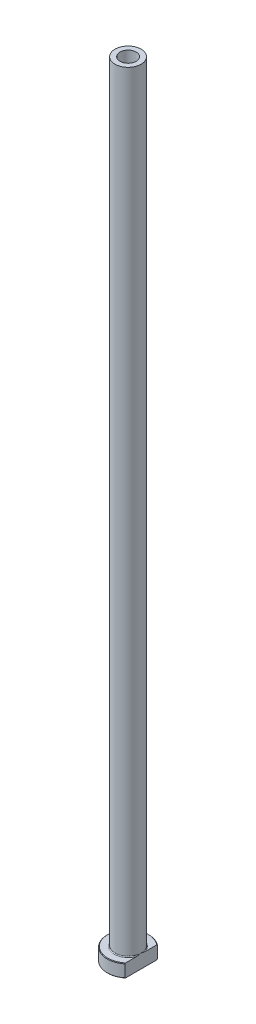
from build123d import *

# Parameters (mm, degrees)
FILLET1_R          = 0.3
CHAMFER1_SIZE      = 0.2
CUT_EXTRUDE1_DEPTH = 301.213257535
CHAMFER2_SIZE      = 0.5


with BuildPart() as part:
    # Sketch1 → Revolve1 (revolve)
    with BuildSketch(Plane.XY, mode=Mode.PRIVATE) as revolve1_sk:
        Polygon((-3.1, 300), (-5, 300), (-5, 5), (-8, 5), (-8, 0), (-3.35, 0), (-3.35, 243), (-3.1, 255), align=None)
    revolve(revolve1_sk.sketch.rotate(Axis((0, 92.187680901, 0), (0, -1, 0)), 270), axis=Axis((0, 92.187680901, 0), (0, -1, 0)))

    # Fillet1
    fillet1_edges = [part.edges().sort_by_distance(p)[0] for p in [
        (0, 5, -5),
    ]]
    fillet(fillet1_edges, radius=FILLET1_R)

    # Chamfer1
    chamfer1_edges = [part.edges().sort_by_distance(p)[0] for p in [
        (0, 0, -8),
        (0, 5, -8),
    ]]
    chamfer(chamfer1_edges, length=CHAMFER1_SIZE)

    # Sketch2 → Cut-Extrude1 (cut, through all)
    with BuildSketch(Plane.XZ):
        with BuildLine():
            Line((5, 6.244997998), (5, -6.244997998))
            ThreePointArc((5, -6.244997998), (8, 0), (5, 6.244997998))
        make_face()
    extrude(amount=-CUT_EXTRUDE1_DEPTH, mode=Mode.SUBTRACT)

    # Chamfer2
    chamfer2_edges = [part.edges().sort_by_distance(p)[0] for p in [
        (0, 0, -3.35),
    ]]
    chamfer(chamfer2_edges, length=CHAMFER2_SIZE)


solid = part.part
